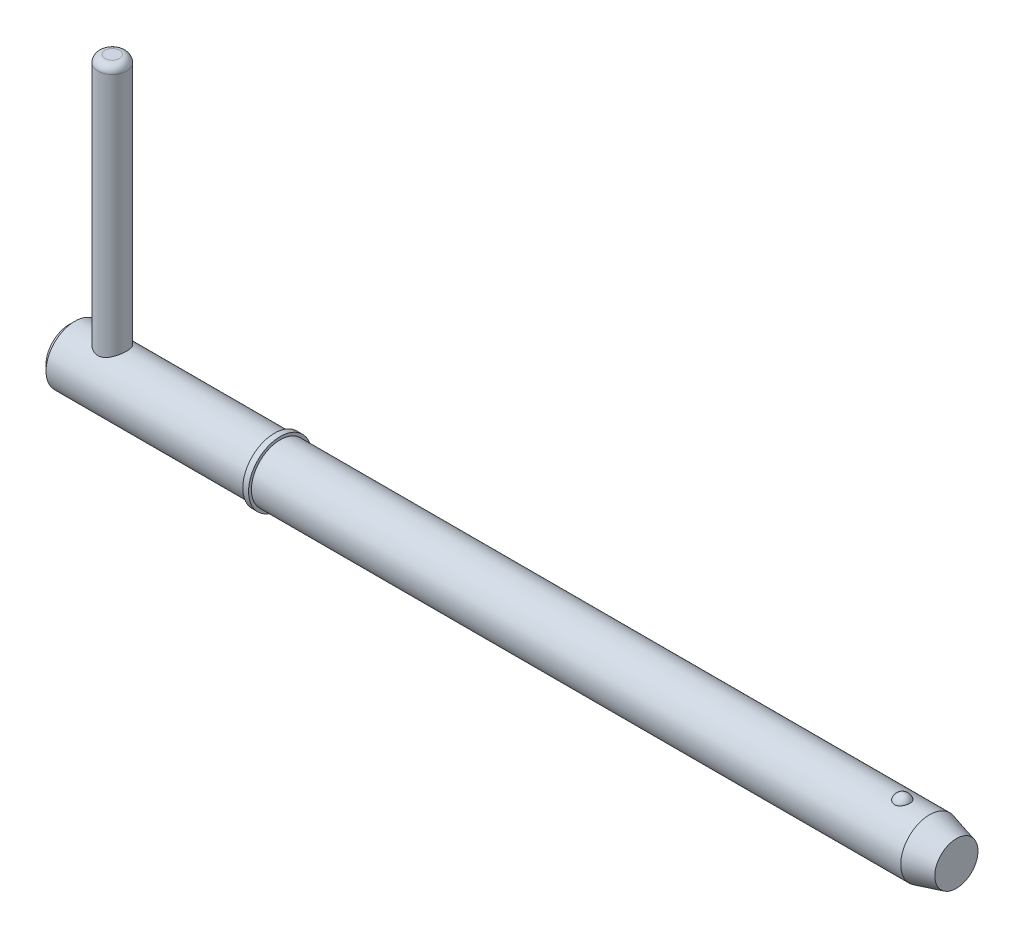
ISO-10303-21;
HEADER;
FILE_DESCRIPTION(('STEP AP214'),'2;1');
FILE_NAME('part.step','',(''),(''),'','','');
FILE_SCHEMA(('AUTOMOTIVE_DESIGN { 1 0 10303 214 1 1 1 1 }'));
ENDSEC;
DATA;
#1=APPLICATION_CONTEXT('core data for automotive mechanical design processes');
#2=APPLICATION_PROTOCOL_DEFINITION('international standard','automotive_design',2000,#1);
#3=PRODUCT_CONTEXT('',#1,'mechanical');
#4=PRODUCT('Part','Part','',(#3));
#5=PRODUCT_RELATED_PRODUCT_CATEGORY('part','',(#4));
#6=PRODUCT_DEFINITION_FORMATION('','',#4);
#7=PRODUCT_DEFINITION_CONTEXT('part definition',#1,'design');
#8=PRODUCT_DEFINITION('design','',#6,#7);
#9=PRODUCT_DEFINITION_SHAPE('','',#8);
#10=(LENGTH_UNIT() NAMED_UNIT(*) SI_UNIT(.MILLI.,.METRE.));
#11=(NAMED_UNIT(*) PLANE_ANGLE_UNIT() SI_UNIT($,.RADIAN.));
#12=(NAMED_UNIT(*) SI_UNIT($,.STERADIAN.) SOLID_ANGLE_UNIT());
#13=UNCERTAINTY_MEASURE_WITH_UNIT(LENGTH_MEASURE(1.E-05),#10,'distance_accuracy_value','');
#14=(GEOMETRIC_REPRESENTATION_CONTEXT(3) GLOBAL_UNCERTAINTY_ASSIGNED_CONTEXT((#13)) GLOBAL_UNIT_ASSIGNED_CONTEXT((#10,
#11,#12)) REPRESENTATION_CONTEXT('',''));
#15=CARTESIAN_POINT('',(0.,0.,0.));
#16=DIRECTION('',(0.,0.,1.));
#17=DIRECTION('',(1.,0.,0.));
#18=AXIS2_PLACEMENT_3D('',#15,#16,#17);
#19=CARTESIAN_POINT('',(3.57,23.02,0.));
#20=DIRECTION('',(0.,-1.,0.));
#21=DIRECTION('',(0.,0.,-1.));
#22=AXIS2_PLACEMENT_3D('',#19,#20,#21);
#23=CYLINDRICAL_SURFACE('',#22,1.19);
#24=CARTESIAN_POINT('',(3.57,-1.785,0.));
#25=DIRECTION('',(0.,1.,0.));
#26=DIRECTION('',(0.,0.,1.));
#27=AXIS2_PLACEMENT_3D('',#24,#25,#26);
#28=CIRCLE('',#27,1.19);
#29=CARTESIAN_POINT('',(3.57,-1.785,1.19));
#30=VERTEX_POINT('',#29);
#31=EDGE_CURVE('P0_E25',#30,#30,#28,.T.);
#32=ORIENTED_EDGE('',*,*,#31,.T.);
#33=EDGE_LOOP('',(#32));
#34=FACE_BOUND('',#33,.T.);
#35=CARTESIAN_POINT('',(3.57,22.425,0.));
#36=DIRECTION('',(0.,1.,0.));
#37=DIRECTION('',(0.,0.,1.));
#38=AXIS2_PLACEMENT_3D('',#35,#36,#37);
#39=CIRCLE('',#38,1.19);
#40=CARTESIAN_POINT('',(3.57,22.425,1.19));
#41=VERTEX_POINT('',#40);
#42=EDGE_CURVE('P0_E29',#41,#41,#39,.F.);
#43=ORIENTED_EDGE('',*,*,#42,.T.);
#44=EDGE_LOOP('',(#43));
#45=FACE_BOUND('',#44,.T.);
#46=ADVANCED_FACE('P0_F14',(#34,#45),#23,.T.);
#47=CARTESIAN_POINT('',(3.57,23.02,0.));
#48=DIRECTION('',(0.,1.,0.));
#49=DIRECTION('',(0.,0.,1.));
#50=AXIS2_PLACEMENT_3D('',#47,#48,#49);
#51=PLANE('',#50);
#52=CARTESIAN_POINT('',(3.57,23.02,0.));
#53=DIRECTION('',(0.,1.,0.));
#54=DIRECTION('',(0.,0.,1.));
#55=AXIS2_PLACEMENT_3D('',#52,#53,#54);
#56=CIRCLE('',#55,0.595);
#57=CARTESIAN_POINT('',(3.57,23.02,0.595));
#58=VERTEX_POINT('',#57);
#59=EDGE_CURVE('P0_E10',#58,#58,#56,.T.);
#60=ORIENTED_EDGE('',*,*,#59,.T.);
#61=EDGE_LOOP('',(#60));
#62=FACE_BOUND('',#61,.T.);
#63=ADVANCED_FACE('P0_F46',(#62),#51,.T.);
#64=CARTESIAN_POINT('',(3.57,-2.38,0.));
#65=DIRECTION('',(0.,1.,0.));
#66=DIRECTION('',(0.,0.,1.));
#67=AXIS2_PLACEMENT_3D('',#64,#65,#66);
#68=PLANE('',#67);
#69=CARTESIAN_POINT('',(3.57,-2.38,0.));
#70=DIRECTION('',(0.,1.,0.));
#71=DIRECTION('',(0.,0.,1.));
#72=AXIS2_PLACEMENT_3D('',#69,#70,#71);
#73=CIRCLE('',#72,0.595);
#74=CARTESIAN_POINT('',(3.57,-2.38,0.595));
#75=VERTEX_POINT('',#74);
#76=EDGE_CURVE('P0_E21',#75,#75,#73,.F.);
#77=ORIENTED_EDGE('',*,*,#76,.T.);
#78=EDGE_LOOP('',(#77));
#79=FACE_BOUND('',#78,.T.);
#80=ADVANCED_FACE('P0_F43',(#79),#68,.F.);
#81=CARTESIAN_POINT('',(3.57,-1.785,0.));
#82=DIRECTION('',(0.,1.,0.));
#83=DIRECTION('',(0.,0.,1.));
#84=AXIS2_PLACEMENT_3D('',#81,#82,#83);
#85=DEGENERATE_TOROIDAL_SURFACE('',#84,0.595,0.595,.T.);
#86=ORIENTED_EDGE('',*,*,#76,.F.);
#87=EDGE_LOOP('',(#86));
#88=FACE_BOUND('',#87,.T.);
#89=ORIENTED_EDGE('',*,*,#31,.F.);
#90=EDGE_LOOP('',(#89));
#91=FACE_BOUND('',#90,.T.);
#92=ADVANCED_FACE('P0_F38',(#88,#91),#85,.T.);
#93=CARTESIAN_POINT('',(3.57,22.425,0.));
#94=DIRECTION('',(0.,1.,0.));
#95=DIRECTION('',(0.,0.,1.));
#96=AXIS2_PLACEMENT_3D('',#93,#94,#95);
#97=DEGENERATE_TOROIDAL_SURFACE('',#96,0.595,0.595,.T.);
#98=ORIENTED_EDGE('',*,*,#42,.F.);
#99=EDGE_LOOP('',(#98));
#100=FACE_BOUND('',#99,.T.);
#101=ORIENTED_EDGE('',*,*,#59,.F.);
#102=EDGE_LOOP('',(#101));
#103=FACE_BOUND('',#102,.T.);
#104=ADVANCED_FACE('P0_F16',(#100,#103),#97,.T.);
#105=CLOSED_SHELL('',(#46,#63,#80,#92,#104));
#106=MANIFOLD_SOLID_BREP('P0_B1',#105);
#107=CARTESIAN_POINT('',(0.,0.,0.));
#108=DIRECTION('',(1.,0.,0.));
#109=DIRECTION('',(0.,0.,-1.));
#110=AXIS2_PLACEMENT_3D('',#107,#108,#109);
#111=CYLINDRICAL_SURFACE('',#110,2.38);
#112=CARTESIAN_POINT('',(71.1094297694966,0.,0.));
#113=DIRECTION('',(1.,0.,0.));
#114=DIRECTION('',(0.,0.,-1.));
#115=AXIS2_PLACEMENT_3D('',#112,#113,#114);
#116=CIRCLE('',#115,2.38);
#117=CARTESIAN_POINT('',(71.1094297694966,0.,-2.38));
#118=VERTEX_POINT('',#117);
#119=EDGE_CURVE('P1_E81',#118,#118,#116,.T.);
#120=ORIENTED_EDGE('',*,*,#119,.F.);
#121=EDGE_LOOP('',(#120));
#122=FACE_BOUND('',#121,.T.);
#123=CARTESIAN_POINT('',(17.45,0.,0.));
#124=DIRECTION('',(1.,0.,0.));
#125=DIRECTION('',(0.,0.,-1.));
#126=AXIS2_PLACEMENT_3D('',#123,#124,#125);
#127=CIRCLE('',#126,2.38);
#128=CARTESIAN_POINT('',(17.45,0.,-2.38));
#129=VERTEX_POINT('',#128);
#130=EDGE_CURVE('P1_E85',#129,#129,#127,.T.);
#131=ORIENTED_EDGE('',*,*,#130,.T.);
#132=EDGE_LOOP('',(#131));
#133=FACE_BOUND('',#132,.T.);
#134=CARTESIAN_POINT('',(68.8634492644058,2.2921568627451,0.640637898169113));
#135=CARTESIAN_POINT('',(68.8303559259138,2.29215737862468,0.64063719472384));
#136=CARTESIAN_POINT('',(68.7972546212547,2.29293179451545,0.637884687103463));
#137=CARTESIAN_POINT('',(68.7320176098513,2.29594030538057,0.626968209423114));
#138=CARTESIAN_POINT('',(68.6998823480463,2.29817506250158,0.618801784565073));
#139=CARTESIAN_POINT('',(68.6375402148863,2.3038430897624,0.597351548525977));
#140=CARTESIAN_POINT('',(68.6073305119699,2.30727454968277,0.584075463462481));
#141=CARTESIAN_POINT('',(68.5495674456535,2.31495941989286,0.552829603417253));
#142=CARTESIAN_POINT('',(68.5220141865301,2.31921286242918,0.534859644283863));
#143=CARTESIAN_POINT('',(68.4695938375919,2.32820213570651,0.494282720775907));
#144=CARTESIAN_POINT('',(68.4448050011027,2.33294694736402,0.471576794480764));
#145=CARTESIAN_POINT('',(68.3992169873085,2.34234144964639,0.422446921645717));
#146=CARTESIAN_POINT('',(68.3784185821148,2.34699112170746,0.396022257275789));
#147=CARTESIAN_POINT('',(68.3403580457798,2.35593942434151,0.338855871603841));
#148=CARTESIAN_POINT('',(68.3233051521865,2.36021170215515,0.307970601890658));
#149=CARTESIAN_POINT('',(68.2943607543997,2.3677057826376,0.243750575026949));
#150=CARTESIAN_POINT('',(68.2824701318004,2.37092740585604,0.210415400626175));
#151=CARTESIAN_POINT('',(68.2638076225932,2.37606901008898,0.141189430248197));
#152=CARTESIAN_POINT('',(68.2571956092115,2.37794816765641,0.105252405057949));
#153=CARTESIAN_POINT('',(68.2498095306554,2.38005135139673,0.032735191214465));
#154=CARTESIAN_POINT('',(68.2490358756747,2.38027526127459,-0.00384504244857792));
#155=CARTESIAN_POINT('',(68.2533628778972,2.37903842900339,-0.0769838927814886));
#156=CARTESIAN_POINT('',(68.2585202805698,2.37756141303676,-0.113538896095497));
#157=CARTESIAN_POINT('',(68.2747013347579,2.37305303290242,-0.185229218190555));
#158=CARTESIAN_POINT('',(68.2857251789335,2.37002161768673,-0.220364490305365));
#159=CARTESIAN_POINT('',(68.3133977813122,2.36273722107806,-0.288156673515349));
#160=CARTESIAN_POINT('',(68.3300389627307,2.35848588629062,-0.320816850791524));
#161=CARTESIAN_POINT('',(68.3685984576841,2.34923130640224,-0.382744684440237));
#162=CARTESIAN_POINT('',(68.390516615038,2.34422808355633,-0.412012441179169));
#163=CARTESIAN_POINT('',(68.4387549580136,2.33412555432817,-0.465830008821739));
#164=CARTESIAN_POINT('',(68.465002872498,2.32902887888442,-0.490444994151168));
#165=CARTESIAN_POINT('',(68.5214769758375,2.31926941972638,-0.534700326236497));
#166=CARTESIAN_POINT('',(68.551702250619,2.3146065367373,-0.554341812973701));
#167=CARTESIAN_POINT('',(68.6140618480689,2.30645675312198,-0.587312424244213));
#168=CARTESIAN_POINT('',(68.6460780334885,2.30293152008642,-0.600855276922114));
#169=CARTESIAN_POINT('',(68.7120795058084,2.29725171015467,-0.622220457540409));
#170=CARTESIAN_POINT('',(68.7460641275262,2.29509667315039,-0.630044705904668));
#171=CARTESIAN_POINT('',(68.813299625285,2.29249264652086,-0.639452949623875));
#172=CARTESIAN_POINT('',(68.8465087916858,2.29196755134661,-0.641315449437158));
#173=CARTESIAN_POINT('',(68.912763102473,2.29246849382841,-0.63952261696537));
#174=CARTESIAN_POINT('',(68.9458082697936,2.29349430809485,-0.635868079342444));
#175=CARTESIAN_POINT('',(69.0101025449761,2.29694059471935,-0.623301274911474));
#176=CARTESIAN_POINT('',(69.0413744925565,2.29933234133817,-0.614497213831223));
#177=CARTESIAN_POINT('',(69.1019952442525,2.30522511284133,-0.592006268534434));
#178=CARTESIAN_POINT('',(69.1313438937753,2.30872622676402,-0.578318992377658));
#179=CARTESIAN_POINT('',(69.1880369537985,2.31655795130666,-0.546112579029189));
#180=CARTESIAN_POINT('',(69.215320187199,2.32090569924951,-0.52749010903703));
#181=CARTESIAN_POINT('',(69.2664904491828,2.3299220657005,-0.486117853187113));
#182=CARTESIAN_POINT('',(69.2903767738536,2.33459075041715,-0.463367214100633));
#183=CARTESIAN_POINT('',(69.3352722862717,2.34399834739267,-0.413220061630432));
#184=CARTESIAN_POINT('',(69.3560972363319,2.34873051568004,-0.385657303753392));
#185=CARTESIAN_POINT('',(69.393056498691,2.35754932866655,-0.327455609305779));
#186=CARTESIAN_POINT('',(69.4091898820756,2.36163584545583,-0.296816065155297));
#187=CARTESIAN_POINT('',(69.4369822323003,2.36889321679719,-0.23204704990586));
#188=CARTESIAN_POINT('',(69.4484450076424,2.37202275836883,-0.197828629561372));
#189=CARTESIAN_POINT('',(69.4657523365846,2.37681926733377,-0.127900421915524));
#190=CARTESIAN_POINT('',(69.4715962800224,2.37848607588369,-0.0921904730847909));
#191=CARTESIAN_POINT('',(69.477605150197,2.38020024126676,-0.0196348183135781));
#192=CARTESIAN_POINT('',(69.4776704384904,2.38021918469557,0.0172198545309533));
#193=CARTESIAN_POINT('',(69.4718689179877,2.37856356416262,0.0904219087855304));
#194=CARTESIAN_POINT('',(69.4660018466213,2.37688892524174,0.126769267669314));
#195=CARTESIAN_POINT('',(69.448425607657,2.37201688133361,0.198028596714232));
#196=CARTESIAN_POINT('',(69.4366998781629,2.36881516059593,0.232936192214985));
#197=CARTESIAN_POINT('',(69.4076354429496,2.36123444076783,0.300196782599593));
#198=CARTESIAN_POINT('',(69.3902967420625,2.3568554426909,0.332549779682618));
#199=CARTESIAN_POINT('',(69.3505350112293,2.34744667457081,0.39349541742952));
#200=CARTESIAN_POINT('',(69.3281528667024,2.34242227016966,0.422115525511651));
#201=CARTESIAN_POINT('',(69.2787391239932,2.33227293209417,0.475004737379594));
#202=CARTESIAN_POINT('',(69.2517076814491,2.32714800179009,0.499273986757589));
#203=CARTESIAN_POINT('',(69.1944988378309,2.31755359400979,0.542046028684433));
#204=CARTESIAN_POINT('',(69.1644297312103,2.3130698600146,0.560690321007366));
#205=CARTESIAN_POINT('',(69.1013869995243,2.30514125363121,0.592447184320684));
#206=CARTESIAN_POINT('',(69.0684158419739,2.30169550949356,0.605564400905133));
#207=CARTESIAN_POINT('',(69.0068424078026,2.29677744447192,0.623927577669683));
#208=CARTESIAN_POINT('',(68.9785555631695,2.295058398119,0.630178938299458));
#209=CARTESIAN_POINT('',(68.9213308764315,2.29274795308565,0.638534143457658));
#210=CARTESIAN_POINT('',(68.8923931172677,2.29215641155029,0.640638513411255));
#211=CARTESIAN_POINT('',(68.8634492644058,2.2921568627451,0.640637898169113));
#212=B_SPLINE_CURVE_WITH_KNOTS('',3,(#134,#135,#136,#137,#138,#139,#140,#141,#142,#143,#144,
#145,#146,#147,#148,#149,#150,#151,#152,#153,#154,#155,#156,#157,#158,#159,#160,#161,#162,#163,
#164,#165,#166,#167,#168,#169,#170,#171,#172,#173,#174,#175,#176,#177,#178,#179,#180,#181,#182,
#183,#184,#185,#186,#187,#188,#189,#190,#191,#192,#193,#194,#195,#196,#197,#198,#199,#200,#201,
#202,#203,#204,#205,#206,#207,#208,#209,#210,#211),.UNSPECIFIED.,.T.,.F.,(4,2,2,2,2,2,2,2,2,2,2,
2,2,2,2,2,2,2,2,2,2,2,2,2,2,2,2,2,2,2,2,2,2,2,2,2,2,2,4),(0.,0.0991724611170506,
0.198389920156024,0.297457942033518,0.396529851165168,0.497927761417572,0.59934527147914,
0.70547553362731,0.811623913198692,0.920876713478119,1.03013718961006,1.14045177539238,
1.25076998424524,1.36093998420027,1.47110672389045,1.57959248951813,1.68805336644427,
1.79234266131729,1.89659691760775,1.9959039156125,2.09519661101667,2.19247425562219,
2.2897597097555,2.38926978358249,2.48880044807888,2.59293588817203,2.69709193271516,
2.80525821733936,2.91343624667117,3.0234791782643,3.13352698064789,3.24388765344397,
3.35424823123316,3.46374443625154,3.57323697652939,3.67968690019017,3.78604717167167,
3.87279565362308,3.9595331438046),.UNSPECIFIED.);
#213=CARTESIAN_POINT('',(68.8634492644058,2.2921568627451,0.640637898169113));
#214=VERTEX_POINT('',#213);
#215=EDGE_CURVE('P1_E35',#214,#214,#212,.T.);
#216=ORIENTED_EDGE('',*,*,#215,.T.);
#217=EDGE_LOOP('',(#216));
#218=FACE_BOUND('',#217,.T.);
#219=ADVANCED_FACE('P1_F13',(#122,#133,#218),#111,.T.);
#220=CARTESIAN_POINT('',(0.,0.,0.));
#221=DIRECTION('',(-1.,0.,0.));
#222=DIRECTION('',(0.,0.,1.));
#223=AXIS2_PLACEMENT_3D('',#220,#221,#222);
#224=PLANE('',#223);
#225=CARTESIAN_POINT('',(0.,0.,0.));
#226=DIRECTION('',(1.,0.,0.));
#227=DIRECTION('',(0.,0.,-1.));
#228=AXIS2_PLACEMENT_3D('',#225,#226,#227);
#229=CIRCLE('',#228,1.904);
#230=CARTESIAN_POINT('',(0.,0.,-1.904));
#231=VERTEX_POINT('',#230);
#232=EDGE_CURVE('P1_E9',#231,#231,#229,.T.);
#233=ORIENTED_EDGE('',*,*,#232,.F.);
#234=EDGE_LOOP('',(#233));
#235=FACE_BOUND('',#234,.T.);
#236=ADVANCED_FACE('P1_F15',(#235),#224,.T.);
#237=CARTESIAN_POINT('',(0.475999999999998,0.,0.));
#238=DIRECTION('',(1.,0.,0.));
#239=DIRECTION('',(0.,0.,-1.));
#240=AXIS2_PLACEMENT_3D('',#237,#238,#239);
#241=CONICAL_SURFACE('',#240,2.38,0.78539816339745);
#242=ORIENTED_EDGE('',*,*,#232,.T.);
#243=EDGE_LOOP('',(#242));
#244=FACE_BOUND('',#243,.T.);
#245=CARTESIAN_POINT('',(0.475999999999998,0.,0.));
#246=DIRECTION('',(1.,0.,0.));
#247=DIRECTION('',(0.,0.,-1.));
#248=AXIS2_PLACEMENT_3D('',#245,#246,#247);
#249=CIRCLE('',#248,2.38);
#250=CARTESIAN_POINT('',(0.475999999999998,0.,-2.38));
#251=VERTEX_POINT('',#250);
#252=EDGE_CURVE('P1_E26',#251,#251,#249,.T.);
#253=ORIENTED_EDGE('',*,*,#252,.F.);
#254=EDGE_LOOP('',(#253));
#255=FACE_BOUND('',#254,.T.);
#256=ADVANCED_FACE('P1_F77',(#244,#255),#241,.T.);
#257=CARTESIAN_POINT('',(0.,0.,0.));
#258=DIRECTION('',(1.,0.,0.));
#259=DIRECTION('',(0.,0.,-1.));
#260=AXIS2_PLACEMENT_3D('',#257,#258,#259);
#261=CYLINDRICAL_SURFACE('',#260,2.38);
#262=CARTESIAN_POINT('',(3.57,-2.06114046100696,1.19));
#263=CARTESIAN_POINT('',(3.50799170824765,-2.06114586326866,1.18999567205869));
#264=CARTESIAN_POINT('',(3.4459051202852,-2.0639812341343,1.18512096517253));
#265=CARTESIAN_POINT('',(3.32363755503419,-2.07491216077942,1.16587061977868));
#266=CARTESIAN_POINT('',(3.26346086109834,-2.08301876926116,1.15147501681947));
#267=CARTESIAN_POINT('',(3.14701251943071,-2.10331722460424,1.11395893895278));
#268=CARTESIAN_POINT('',(3.09072196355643,-2.1154873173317,1.09088484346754));
#269=CARTESIAN_POINT('',(2.9828251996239,-2.14250771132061,1.03680835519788));
#270=CARTESIAN_POINT('',(2.93121924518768,-2.15735815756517,1.00580553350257));
#271=CARTESIAN_POINT('',(2.82945618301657,-2.18956274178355,0.933753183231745));
#272=CARTESIAN_POINT('',(2.77976962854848,-2.20702235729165,0.892085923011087));
#273=CARTESIAN_POINT('',(2.68772401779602,-2.2416265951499,0.801172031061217));
#274=CARTESIAN_POINT('',(2.64536861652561,-2.25877105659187,0.751921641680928));
#275=CARTESIAN_POINT('',(2.56639309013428,-2.29219557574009,0.64318258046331));
#276=CARTESIAN_POINT('',(2.53035201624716,-2.30833946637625,0.583227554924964));
#277=CARTESIAN_POINT('',(2.46908238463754,-2.3365739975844,0.45714686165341));
#278=CARTESIAN_POINT('',(2.44384700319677,-2.34866719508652,0.391025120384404));
#279=CARTESIAN_POINT('',(2.40676945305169,-2.36667748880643,0.259473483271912));
#280=CARTESIAN_POINT('',(2.39410206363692,-2.37297281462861,0.194329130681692));
#281=CARTESIAN_POINT('',(2.3798023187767,-2.3800902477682,0.0625590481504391));
#282=CARTESIAN_POINT('',(2.37816328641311,-2.38091566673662,-0.00406576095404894));
#283=CARTESIAN_POINT('',(2.38564854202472,-2.37717948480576,-0.130700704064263));
#284=CARTESIAN_POINT('',(2.39384923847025,-2.37308010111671,-0.190782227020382));
#285=CARTESIAN_POINT('',(2.41912820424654,-2.360653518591,-0.308583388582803));
#286=CARTESIAN_POINT('',(2.43620713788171,-2.35232600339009,-0.366302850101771));
#287=CARTESIAN_POINT('',(2.47886825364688,-2.33206184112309,-0.478748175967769));
#288=CARTESIAN_POINT('',(2.50456481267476,-2.32007685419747,-0.533421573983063));
#289=CARTESIAN_POINT('',(2.56357346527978,-2.29357798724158,-0.637812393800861));
#290=CARTESIAN_POINT('',(2.5968882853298,-2.27906320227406,-0.687528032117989));
#291=CARTESIAN_POINT('',(2.67380546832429,-2.24724829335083,-0.785606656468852));
#292=CARTESIAN_POINT('',(2.71808260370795,-2.22981457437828,-0.833397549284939));
#293=CARTESIAN_POINT('',(2.81386177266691,-2.19500665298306,-0.921184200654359));
#294=CARTESIAN_POINT('',(2.86536931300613,-2.17763250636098,-0.961173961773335));
#295=CARTESIAN_POINT('',(2.97815134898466,-2.14371545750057,-1.03471134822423));
#296=CARTESIAN_POINT('',(3.03983836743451,-2.12729540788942,-1.06768860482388));
#297=CARTESIAN_POINT('',(3.16889582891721,-2.09886785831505,-1.12254974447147));
#298=CARTESIAN_POINT('',(3.2362602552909,-2.0868557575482,-1.14444520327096));
#299=CARTESIAN_POINT('',(3.36914526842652,-2.06994116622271,-1.1747444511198));
#300=CARTESIAN_POINT('',(3.43438893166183,-2.06455070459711,-1.18407989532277));
#301=CARTESIAN_POINT('',(3.56571759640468,-2.06010324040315,-1.1918051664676));
#302=CARTESIAN_POINT('',(3.63180197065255,-2.06104176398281,-1.19020272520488));
#303=CARTESIAN_POINT('',(3.75522816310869,-2.06862860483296,-1.17695289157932));
#304=CARTESIAN_POINT('',(3.81273554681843,-2.07464109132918,-1.16642350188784));
#305=CARTESIAN_POINT('',(3.92505766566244,-2.09075885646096,-1.1372785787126));
#306=CARTESIAN_POINT('',(3.97987152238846,-2.1008654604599,-1.1186604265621));
#307=CARTESIAN_POINT('',(4.08813948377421,-2.12458104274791,-1.07296063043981));
#308=CARTESIAN_POINT('',(4.14141303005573,-2.13833055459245,-1.04552693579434));
#309=CARTESIAN_POINT('',(4.2429084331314,-2.16765782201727,-0.983281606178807));
#310=CARTESIAN_POINT('',(4.29112767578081,-2.18323651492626,-0.948466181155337));
#311=CARTESIAN_POINT('',(4.38750473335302,-2.2168271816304,-0.867316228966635));
#312=CARTESIAN_POINT('',(4.43488860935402,-2.23489833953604,-0.82008287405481));
#313=CARTESIAN_POINT('',(4.52130056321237,-2.26973739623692,-0.718051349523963));
#314=CARTESIAN_POINT('',(4.56032581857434,-2.28650485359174,-0.663250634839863));
#315=CARTESIAN_POINT('',(4.62978273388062,-2.31742220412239,-0.545657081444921));
#316=CARTESIAN_POINT('',(4.65996041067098,-2.33149133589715,-0.482691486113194));
#317=CARTESIAN_POINT('',(4.7089941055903,-2.35481192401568,-0.351671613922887));
#318=CARTESIAN_POINT('',(4.7278600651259,-2.36406760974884,-0.283621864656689));
#319=CARTESIAN_POINT('',(4.75210859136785,-2.3760433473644,-0.151105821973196));
#320=CARTESIAN_POINT('',(4.75856947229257,-2.37928514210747,-0.0868836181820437));
#321=CARTESIAN_POINT('',(4.76100348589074,-2.38050135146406,0.0417999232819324));
#322=CARTESIAN_POINT('',(4.75698028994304,-2.37847760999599,0.106261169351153));
#323=CARTESIAN_POINT('',(4.73927447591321,-2.36969422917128,0.229120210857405));
#324=CARTESIAN_POINT('',(4.72624582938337,-2.36325544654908,0.287637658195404));
#325=CARTESIAN_POINT('',(4.69178087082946,-2.34658591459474,0.401560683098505));
#326=CARTESIAN_POINT('',(4.67034335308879,-2.33635462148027,0.456965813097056));
#327=CARTESIAN_POINT('',(4.61871480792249,-2.31247857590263,0.565753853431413));
#328=CARTESIAN_POINT('',(4.58818860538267,-2.29870654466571,0.618948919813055));
#329=CARTESIAN_POINT('',(4.51967006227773,-2.26918878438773,0.719681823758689));
#330=CARTESIAN_POINT('',(4.48167429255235,-2.25344215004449,0.76721704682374));
#331=CARTESIAN_POINT('',(4.39491140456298,-2.21969046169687,0.860267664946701));
#332=CARTESIAN_POINT('',(4.34544863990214,-2.20161660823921,0.905111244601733));
#333=CARTESIAN_POINT('',(4.23943364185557,-2.16655060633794,0.986109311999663));
#334=CARTESIAN_POINT('',(4.18287520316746,-2.1495594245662,1.02225611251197));
#335=CARTESIAN_POINT('',(4.06190239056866,-2.1181953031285,1.08579298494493));
#336=CARTESIAN_POINT('',(3.9972962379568,-2.10392207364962,1.11287022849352));
#337=CARTESIAN_POINT('',(3.86353443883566,-2.08090726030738,1.15534566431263));
#338=CARTESIAN_POINT('',(3.7943948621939,-2.07214719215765,1.17078291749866));
#339=CARTESIAN_POINT('',(3.69875162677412,-2.06499834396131,1.18329673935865));
#340=CARTESIAN_POINT('',(3.67309220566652,-2.06355673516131,1.18580656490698));
#341=CARTESIAN_POINT('',(3.62162638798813,-2.06162663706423,1.18915915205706));
#342=CARTESIAN_POINT('',(3.59581998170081,-2.0611382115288,1.19000180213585));
#343=CARTESIAN_POINT('',(3.57,-2.06114046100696,1.19));
#344=B_SPLINE_CURVE_WITH_KNOTS('',3,(#262,#263,#264,#265,#266,#267,#268,#269,#270,#271,#272,
#273,#274,#275,#276,#277,#278,#279,#280,#281,#282,#283,#284,#285,#286,#287,#288,#289,#290,#291,
#292,#293,#294,#295,#296,#297,#298,#299,#300,#301,#302,#303,#304,#305,#306,#307,#308,#309,#310,
#311,#312,#313,#314,#315,#316,#317,#318,#319,#320,#321,#322,#323,#324,#325,#326,#327,#328,#329,
#330,#331,#332,#333,#334,#335,#336,#337,#338,#339,#340,#341,#342,#343),.UNSPECIFIED.,.T.,.F.,(4,
2,2,2,2,2,2,2,2,2,2,2,2,2,2,2,2,2,2,2,2,2,2,2,2,2,2,2,2,2,2,2,2,2,2,2,2,2,2,2,4),(0.,
0.185916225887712,0.372223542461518,0.557549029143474,0.742884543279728,0.943506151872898,
1.14422749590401,1.35847891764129,1.5725948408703,1.77147547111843,1.97023568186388,
2.15171156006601,2.33320101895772,2.51720146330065,2.70126786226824,2.902733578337,
3.10435357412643,3.31877721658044,3.53297641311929,3.73020126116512,3.92728670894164,
4.1028127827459,4.27839572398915,4.46211082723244,4.64592048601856,4.8529002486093,
5.0599497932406,5.27246375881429,5.48479067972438,5.67763601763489,5.87041383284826,
6.05048865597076,6.23058930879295,6.41839293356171,6.60628297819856,6.8128718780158,
7.01964271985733,7.2329479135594,7.44553408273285,7.52294360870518,7.60035831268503),.UNSPECIFIED.);
#345=CARTESIAN_POINT('',(3.57,-2.06114046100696,1.19));
#346=VERTEX_POINT('',#345);
#347=EDGE_CURVE('P1_E17',#346,#346,#344,.T.);
#348=ORIENTED_EDGE('',*,*,#347,.F.);
#349=EDGE_LOOP('',(#348));
#350=FACE_BOUND('',#349,.T.);
#351=CARTESIAN_POINT('',(3.57,2.06114046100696,1.19));
#352=CARTESIAN_POINT('',(3.63200829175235,2.06114586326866,1.18999567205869));
#353=CARTESIAN_POINT('',(3.6940948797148,2.0639812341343,1.18512096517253));
#354=CARTESIAN_POINT('',(3.81636244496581,2.07491216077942,1.16587061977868));
#355=CARTESIAN_POINT('',(3.87653913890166,2.08301876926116,1.15147501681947));
#356=CARTESIAN_POINT('',(3.99298748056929,2.10331722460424,1.11395893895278));
#357=CARTESIAN_POINT('',(4.04927803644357,2.1154873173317,1.09088484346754));
#358=CARTESIAN_POINT('',(4.1571748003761,2.14250771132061,1.03680835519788));
#359=CARTESIAN_POINT('',(4.20878075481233,2.15735815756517,1.00580553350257));
#360=CARTESIAN_POINT('',(4.31054381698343,2.18956274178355,0.933753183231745));
#361=CARTESIAN_POINT('',(4.36023037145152,2.20702235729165,0.892085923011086));
#362=CARTESIAN_POINT('',(4.45227598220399,2.2416265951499,0.801172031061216));
#363=CARTESIAN_POINT('',(4.49463138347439,2.25877105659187,0.751921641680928));
#364=CARTESIAN_POINT('',(4.57360690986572,2.29219557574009,0.643182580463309));
#365=CARTESIAN_POINT('',(4.60964798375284,2.30833946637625,0.583227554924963));
#366=CARTESIAN_POINT('',(4.67091761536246,2.3365739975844,0.457146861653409));
#367=CARTESIAN_POINT('',(4.69615299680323,2.34866719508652,0.391025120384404));
#368=CARTESIAN_POINT('',(4.73323054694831,2.36667748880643,0.259473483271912));
#369=CARTESIAN_POINT('',(4.74589793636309,2.37297281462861,0.194329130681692));
#370=CARTESIAN_POINT('',(4.7601976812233,2.3800902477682,0.0625590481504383));
#371=CARTESIAN_POINT('',(4.76183671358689,2.38091566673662,-0.00406576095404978));
#372=CARTESIAN_POINT('',(4.75435145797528,2.37717948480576,-0.130700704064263));
#373=CARTESIAN_POINT('',(4.74615076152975,2.37308010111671,-0.190782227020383));
#374=CARTESIAN_POINT('',(4.72087179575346,2.360653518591,-0.308583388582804));
#375=CARTESIAN_POINT('',(4.70379286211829,2.35232600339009,-0.366302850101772));
#376=CARTESIAN_POINT('',(4.66113174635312,2.33206184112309,-0.478748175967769));
#377=CARTESIAN_POINT('',(4.63543518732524,2.32007685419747,-0.533421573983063));
#378=CARTESIAN_POINT('',(4.57642653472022,2.29357798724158,-0.637812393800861));
#379=CARTESIAN_POINT('',(4.5431117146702,2.27906320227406,-0.687528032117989));
#380=CARTESIAN_POINT('',(4.46619453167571,2.24724829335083,-0.785606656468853));
#381=CARTESIAN_POINT('',(4.42191739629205,2.22981457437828,-0.83339754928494));
#382=CARTESIAN_POINT('',(4.32613822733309,2.19500665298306,-0.921184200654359));
#383=CARTESIAN_POINT('',(4.27463068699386,2.17763250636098,-0.961173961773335));
#384=CARTESIAN_POINT('',(4.16184865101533,2.14371545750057,-1.03471134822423));
#385=CARTESIAN_POINT('',(4.10016163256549,2.12729540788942,-1.06768860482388));
#386=CARTESIAN_POINT('',(3.97110417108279,2.09886785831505,-1.12254974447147));
#387=CARTESIAN_POINT('',(3.9037397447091,2.0868557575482,-1.14444520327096));
#388=CARTESIAN_POINT('',(3.77085473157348,2.06994116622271,-1.1747444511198));
#389=CARTESIAN_POINT('',(3.70561106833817,2.06455070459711,-1.18407989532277));
#390=CARTESIAN_POINT('',(3.57428240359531,2.06010324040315,-1.1918051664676));
#391=CARTESIAN_POINT('',(3.50819802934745,2.06104176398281,-1.19020272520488));
#392=CARTESIAN_POINT('',(3.38477183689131,2.06862860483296,-1.17695289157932));
#393=CARTESIAN_POINT('',(3.32726445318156,2.07464109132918,-1.16642350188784));
#394=CARTESIAN_POINT('',(3.21494233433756,2.09075885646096,-1.1372785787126));
#395=CARTESIAN_POINT('',(3.16012847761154,2.1008654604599,-1.1186604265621));
#396=CARTESIAN_POINT('',(3.05186051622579,2.12458104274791,-1.07296063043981));
#397=CARTESIAN_POINT('',(2.99858696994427,2.13833055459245,-1.04552693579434));
#398=CARTESIAN_POINT('',(2.8970915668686,2.16765782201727,-0.983281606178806));
#399=CARTESIAN_POINT('',(2.84887232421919,2.18323651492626,-0.948466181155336));
#400=CARTESIAN_POINT('',(2.75249526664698,2.2168271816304,-0.867316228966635));
#401=CARTESIAN_POINT('',(2.70511139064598,2.23489833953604,-0.820082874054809));
#402=CARTESIAN_POINT('',(2.61869943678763,2.26973739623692,-0.718051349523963));
#403=CARTESIAN_POINT('',(2.57967418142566,2.28650485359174,-0.663250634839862));
#404=CARTESIAN_POINT('',(2.51021726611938,2.31742220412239,-0.54565708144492));
#405=CARTESIAN_POINT('',(2.48003958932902,2.33149133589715,-0.482691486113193));
#406=CARTESIAN_POINT('',(2.4310058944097,2.35481192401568,-0.351671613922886));
#407=CARTESIAN_POINT('',(2.4121399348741,2.36406760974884,-0.283621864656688));
#408=CARTESIAN_POINT('',(2.38789140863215,2.3760433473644,-0.151105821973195));
#409=CARTESIAN_POINT('',(2.38143052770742,2.37928514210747,-0.0868836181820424));
#410=CARTESIAN_POINT('',(2.37899651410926,2.38050135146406,0.0417999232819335));
#411=CARTESIAN_POINT('',(2.38301971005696,2.37847760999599,0.106261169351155));
#412=CARTESIAN_POINT('',(2.40072552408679,2.36969422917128,0.229120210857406));
#413=CARTESIAN_POINT('',(2.41375417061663,2.36325544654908,0.287637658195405));
#414=CARTESIAN_POINT('',(2.44821912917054,2.34658591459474,0.401560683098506));
#415=CARTESIAN_POINT('',(2.46965664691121,2.33635462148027,0.456965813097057));
#416=CARTESIAN_POINT('',(2.52128519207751,2.31247857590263,0.565753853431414));
#417=CARTESIAN_POINT('',(2.55181139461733,2.29870654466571,0.618948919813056));
#418=CARTESIAN_POINT('',(2.62032993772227,2.26918878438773,0.719681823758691));
#419=CARTESIAN_POINT('',(2.65832570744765,2.25344215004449,0.767217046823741));
#420=CARTESIAN_POINT('',(2.74508859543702,2.21969046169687,0.860267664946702));
#421=CARTESIAN_POINT('',(2.79455136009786,2.20161660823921,0.905111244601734));
#422=CARTESIAN_POINT('',(2.90056635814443,2.16655060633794,0.986109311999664));
#423=CARTESIAN_POINT('',(2.95712479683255,2.1495594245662,1.02225611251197));
#424=CARTESIAN_POINT('',(3.07809760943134,2.1181953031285,1.08579298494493));
#425=CARTESIAN_POINT('',(3.1427037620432,2.10392207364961,1.11287022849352));
#426=CARTESIAN_POINT('',(3.27646556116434,2.08090726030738,1.15534566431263));
#427=CARTESIAN_POINT('',(3.3456051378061,2.07214719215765,1.17078291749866));
#428=CARTESIAN_POINT('',(3.44124837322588,2.06499834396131,1.18329673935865));
#429=CARTESIAN_POINT('',(3.46690779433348,2.06355673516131,1.18580656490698));
#430=CARTESIAN_POINT('',(3.51837361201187,2.06162663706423,1.18915915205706));
#431=CARTESIAN_POINT('',(3.54418001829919,2.0611382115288,1.19000180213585));
#432=CARTESIAN_POINT('',(3.57,2.06114046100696,1.19));
#433=B_SPLINE_CURVE_WITH_KNOTS('',3,(#351,#352,#353,#354,#355,#356,#357,#358,#359,#360,#361,
#362,#363,#364,#365,#366,#367,#368,#369,#370,#371,#372,#373,#374,#375,#376,#377,#378,#379,#380,
#381,#382,#383,#384,#385,#386,#387,#388,#389,#390,#391,#392,#393,#394,#395,#396,#397,#398,#399,
#400,#401,#402,#403,#404,#405,#406,#407,#408,#409,#410,#411,#412,#413,#414,#415,#416,#417,#418,
#419,#420,#421,#422,#423,#424,#425,#426,#427,#428,#429,#430,#431,#432),.UNSPECIFIED.,.T.,.F.,(4,
2,2,2,2,2,2,2,2,2,2,2,2,2,2,2,2,2,2,2,2,2,2,2,2,2,2,2,2,2,2,2,2,2,2,2,2,2,2,2,4),(0.,
0.185916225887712,0.372223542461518,0.557549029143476,0.74288454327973,0.9435061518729,
1.14422749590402,1.35847891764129,1.5725948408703,1.77147547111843,1.97023568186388,
2.15171156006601,2.33320101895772,2.51720146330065,2.70126786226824,2.902733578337,
3.10435357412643,3.31877721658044,3.53297641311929,3.73020126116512,3.92728670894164,
4.1028127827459,4.27839572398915,4.46211082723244,4.64592048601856,4.8529002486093,
5.05994979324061,5.27246375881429,5.48479067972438,5.67763601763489,5.87041383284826,
6.05048865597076,6.23058930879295,6.41839293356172,6.60628297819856,6.8128718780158,
7.01964271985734,7.2329479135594,7.44553408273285,7.52294360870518,7.60035831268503),.UNSPECIFIED.);
#434=CARTESIAN_POINT('',(3.57,2.06114046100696,1.19));
#435=VERTEX_POINT('',#434);
#436=EDGE_CURVE('P1_E43',#435,#435,#433,.T.);
#437=ORIENTED_EDGE('',*,*,#436,.F.);
#438=EDGE_LOOP('',(#437));
#439=FACE_BOUND('',#438,.T.);
#440=ORIENTED_EDGE('',*,*,#252,.T.);
#441=EDGE_LOOP('',(#440));
#442=FACE_BOUND('',#441,.T.);
#443=CARTESIAN_POINT('',(16.974,0.,0.));
#444=DIRECTION('',(1.,0.,0.));
#445=DIRECTION('',(0.,0.,-1.));
#446=AXIS2_PLACEMENT_3D('',#443,#444,#445);
#447=CIRCLE('',#446,2.38);
#448=CARTESIAN_POINT('',(16.974,0.,-2.38));
#449=VERTEX_POINT('',#448);
#450=EDGE_CURVE('P1_E31',#449,#449,#447,.T.);
#451=ORIENTED_EDGE('',*,*,#450,.F.);
#452=EDGE_LOOP('',(#451));
#453=FACE_BOUND('',#452,.T.);
#454=ADVANCED_FACE('P1_F103',(#350,#439,#442,#453),#261,.T.);
#455=CARTESIAN_POINT('',(16.974,2.38,0.));
#456=DIRECTION('',(-1.,0.,0.));
#457=DIRECTION('',(0.,0.,1.));
#458=AXIS2_PLACEMENT_3D('',#455,#456,#457);
#459=PLANE('',#458);
#460=ORIENTED_EDGE('',*,*,#450,.T.);
#461=EDGE_LOOP('',(#460));
#462=FACE_BOUND('',#461,.T.);
#463=CARTESIAN_POINT('',(16.974,0.,0.));
#464=DIRECTION('',(1.,0.,0.));
#465=DIRECTION('',(0.,0.,-1.));
#466=AXIS2_PLACEMENT_3D('',#463,#464,#465);
#467=CIRCLE('',#466,2.618);
#468=CARTESIAN_POINT('',(16.974,0.,-2.618));
#469=VERTEX_POINT('',#468);
#470=EDGE_CURVE('P1_E91',#469,#469,#467,.T.);
#471=ORIENTED_EDGE('',*,*,#470,.F.);
#472=EDGE_LOOP('',(#471));
#473=FACE_BOUND('',#472,.T.);
#474=ADVANCED_FACE('P1_F100',(#462,#473),#459,.T.);
#475=CARTESIAN_POINT('',(0.,0.,0.));
#476=DIRECTION('',(1.,0.,0.));
#477=DIRECTION('',(0.,0.,-1.));
#478=AXIS2_PLACEMENT_3D('',#475,#476,#477);
#479=CYLINDRICAL_SURFACE('',#478,2.618);
#480=ORIENTED_EDGE('',*,*,#470,.T.);
#481=EDGE_LOOP('',(#480));
#482=FACE_BOUND('',#481,.T.);
#483=CARTESIAN_POINT('',(17.45,0.,0.));
#484=DIRECTION('',(1.,0.,0.));
#485=DIRECTION('',(0.,0.,-1.));
#486=AXIS2_PLACEMENT_3D('',#483,#484,#485);
#487=CIRCLE('',#486,2.618);
#488=CARTESIAN_POINT('',(17.45,0.,-2.618));
#489=VERTEX_POINT('',#488);
#490=EDGE_CURVE('P1_E88',#489,#489,#487,.T.);
#491=ORIENTED_EDGE('',*,*,#490,.F.);
#492=EDGE_LOOP('',(#491));
#493=FACE_BOUND('',#492,.T.);
#494=ADVANCED_FACE('P1_F68',(#482,#493),#479,.T.);
#495=CARTESIAN_POINT('',(17.45,2.618,0.));
#496=DIRECTION('',(1.,0.,0.));
#497=DIRECTION('',(0.,0.,-1.));
#498=AXIS2_PLACEMENT_3D('',#495,#496,#497);
#499=PLANE('',#498);
#500=ORIENTED_EDGE('',*,*,#490,.T.);
#501=EDGE_LOOP('',(#500));
#502=FACE_BOUND('',#501,.T.);
#503=ORIENTED_EDGE('',*,*,#130,.F.);
#504=EDGE_LOOP('',(#503));
#505=FACE_BOUND('',#504,.T.);
#506=ADVANCED_FACE('P1_F62',(#502,#505),#499,.T.);
#507=CARTESIAN_POINT('',(73.33,0.,0.));
#508=DIRECTION('',(-1.,0.,0.));
#509=DIRECTION('',(0.,0.,1.));
#510=AXIS2_PLACEMENT_3D('',#507,#508,#509);
#511=CONICAL_SURFACE('',#510,1.78500000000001,0.26179938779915);
#512=ORIENTED_EDGE('',*,*,#119,.T.);
#513=EDGE_LOOP('',(#512));
#514=FACE_BOUND('',#513,.T.);
#515=CARTESIAN_POINT('',(73.33,0.,0.));
#516=DIRECTION('',(1.,0.,0.));
#517=DIRECTION('',(0.,0.,-1.));
#518=AXIS2_PLACEMENT_3D('',#515,#516,#517);
#519=CIRCLE('',#518,1.78500000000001);
#520=CARTESIAN_POINT('',(73.33,0.,-1.78500000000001));
#521=VERTEX_POINT('',#520);
#522=EDGE_CURVE('P1_E42',#521,#521,#519,.T.);
#523=ORIENTED_EDGE('',*,*,#522,.F.);
#524=EDGE_LOOP('',(#523));
#525=FACE_BOUND('',#524,.T.);
#526=ADVANCED_FACE('P1_F59',(#514,#525),#511,.T.);
#527=CARTESIAN_POINT('',(73.33,1.78500000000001,0.));
#528=DIRECTION('',(1.,0.,0.));
#529=DIRECTION('',(0.,0.,-1.));
#530=AXIS2_PLACEMENT_3D('',#527,#528,#529);
#531=PLANE('',#530);
#532=ORIENTED_EDGE('',*,*,#522,.T.);
#533=EDGE_LOOP('',(#532));
#534=FACE_BOUND('',#533,.T.);
#535=ADVANCED_FACE('P1_F55',(#534),#531,.T.);
#536=CARTESIAN_POINT('',(68.8634492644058,2.142,0.));
#537=DIRECTION('',(-1.,0.,0.));
#538=DIRECTION('',(0.,1.,0.));
#539=AXIS2_PLACEMENT_3D('',#536,#537,#538);
#540=SPHERICAL_SURFACE('',#539,0.657999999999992);
#541=ORIENTED_EDGE('',*,*,#215,.F.);
#542=EDGE_LOOP('',(#541));
#543=FACE_BOUND('',#542,.T.);
#544=ADVANCED_FACE('P1_F50',(#543),#540,.T.);
#545=CARTESIAN_POINT('',(3.57,-2.618,0.));
#546=DIRECTION('',(0.,1.,0.));
#547=DIRECTION('',(0.,0.,1.));
#548=AXIS2_PLACEMENT_3D('',#545,#546,#547);
#549=CYLINDRICAL_SURFACE('',#548,1.19);
#550=ORIENTED_EDGE('',*,*,#347,.T.);
#551=EDGE_LOOP('',(#550));
#552=FACE_BOUND('',#551,.T.);
#553=ORIENTED_EDGE('',*,*,#436,.T.);
#554=EDGE_LOOP('',(#553));
#555=FACE_BOUND('',#554,.T.);
#556=ADVANCED_FACE('P1_F54',(#552,#555),#549,.F.);
#557=CLOSED_SHELL('',(#219,#236,#256,#454,#474,#494,#506,#526,#535,#544,#556));
#558=MANIFOLD_SOLID_BREP('P1_B1',#557);
#559=ADVANCED_BREP_SHAPE_REPRESENTATION('',(#18,#106,#558),#14);
#560=SHAPE_DEFINITION_REPRESENTATION(#9,#559);
ENDSEC;
END-ISO-10303-21;
